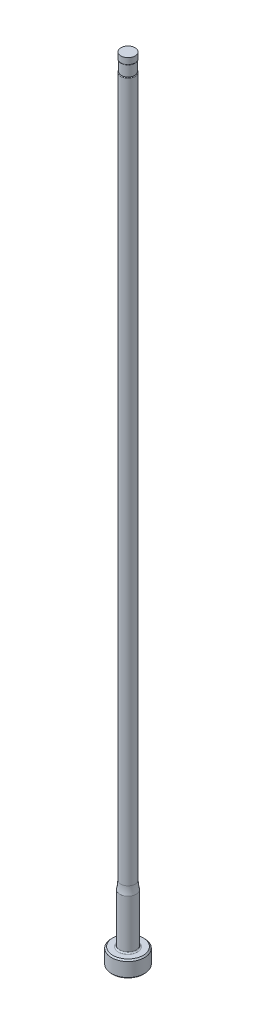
ISO-10303-21;
HEADER;
FILE_DESCRIPTION(('STEP AP214'),'2;1');
FILE_NAME('part.step','',(''),(''),'','','');
FILE_SCHEMA(('AUTOMOTIVE_DESIGN { 1 0 10303 214 1 1 1 1 }'));
ENDSEC;
DATA;
#1=APPLICATION_CONTEXT('core data for automotive mechanical design processes');
#2=APPLICATION_PROTOCOL_DEFINITION('international standard','automotive_design',2000,#1);
#3=PRODUCT_CONTEXT('',#1,'mechanical');
#4=PRODUCT('Part','Part','',(#3));
#5=PRODUCT_RELATED_PRODUCT_CATEGORY('part','',(#4));
#6=PRODUCT_DEFINITION_FORMATION('','',#4);
#7=PRODUCT_DEFINITION_CONTEXT('part definition',#1,'design');
#8=PRODUCT_DEFINITION('design','',#6,#7);
#9=PRODUCT_DEFINITION_SHAPE('','',#8);
#10=(LENGTH_UNIT() NAMED_UNIT(*) SI_UNIT(.MILLI.,.METRE.));
#11=(NAMED_UNIT(*) PLANE_ANGLE_UNIT() SI_UNIT($,.RADIAN.));
#12=(NAMED_UNIT(*) SI_UNIT($,.STERADIAN.) SOLID_ANGLE_UNIT());
#13=UNCERTAINTY_MEASURE_WITH_UNIT(LENGTH_MEASURE(1.E-05),#10,'distance_accuracy_value','');
#14=(GEOMETRIC_REPRESENTATION_CONTEXT(3) GLOBAL_UNCERTAINTY_ASSIGNED_CONTEXT((#13)) GLOBAL_UNIT_ASSIGNED_CONTEXT((#10,
#11,#12)) REPRESENTATION_CONTEXT('',''));
#15=CARTESIAN_POINT('',(0.,0.,0.));
#16=DIRECTION('',(0.,0.,1.));
#17=DIRECTION('',(1.,0.,0.));
#18=AXIS2_PLACEMENT_3D('',#15,#16,#17);
#19=CARTESIAN_POINT('',(0.,259.958771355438,0.));
#20=DIRECTION('',(0.,1.,0.));
#21=DIRECTION('',(0.,0.,1.));
#22=AXIS2_PLACEMENT_3D('',#19,#20,#21);
#23=CYLINDRICAL_SURFACE('',#22,1.38810999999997);
#24=DIRECTION('',(0.,1.,0.));
#25=VECTOR('',#24,1.);
#26=CARTESIAN_POINT('',(-1.28650999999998,259.958771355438,-0.521288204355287));
#27=LINE('',#26,#25);
#28=CARTESIAN_POINT('',(-1.28650999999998,148.973565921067,-0.521288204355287));
#29=VERTEX_POINT('',#28);
#30=CARTESIAN_POINT('',(-1.28650999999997,112.014,-0.521288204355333));
#31=VERTEX_POINT('',#30);
#32=EDGE_CURVE('E66',#29,#31,#27,.F.);
#33=ORIENTED_EDGE('',*,*,#32,.F.);
#34=CARTESIAN_POINT('',(0.,148.973565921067,0.));
#35=DIRECTION('',(0.,1.,0.));
#36=DIRECTION('',(0.,0.,1.));
#37=AXIS2_PLACEMENT_3D('',#34,#35,#36);
#38=CIRCLE('',#37,1.38810999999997);
#39=CARTESIAN_POINT('',(-1.28650999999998,148.973565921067,0.521288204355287));
#40=VERTEX_POINT('',#39);
#41=EDGE_CURVE('E44',#29,#40,#38,.F.);
#42=ORIENTED_EDGE('',*,*,#41,.T.);
#43=DIRECTION('',(0.,1.,0.));
#44=VECTOR('',#43,1.);
#45=CARTESIAN_POINT('',(-1.28650999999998,259.958771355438,0.521288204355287));
#46=LINE('',#45,#44);
#47=CARTESIAN_POINT('',(-1.28650999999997,112.014,0.521288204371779));
#48=VERTEX_POINT('',#47);
#49=EDGE_CURVE('E72',#48,#40,#46,.T.);
#50=ORIENTED_EDGE('',*,*,#49,.F.);
#51=CARTESIAN_POINT('',(-1.28650999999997,112.014,-0.521288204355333));
#52=CARTESIAN_POINT('',(-1.28650942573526,111.988928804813,-0.521284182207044));
#53=CARTESIAN_POINT('',(-1.28680726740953,111.963865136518,-0.520555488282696));
#54=CARTESIAN_POINT('',(-1.28799191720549,111.913826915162,-0.517619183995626));
#55=CARTESIAN_POINT('',(-1.28887900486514,111.888852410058,-0.515410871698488));
#56=CARTESIAN_POINT('',(-1.29243982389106,111.813619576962,-0.506452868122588));
#57=CARTESIAN_POINT('',(-1.29601290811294,111.763650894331,-0.49736839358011));
#58=CARTESIAN_POINT('',(-1.30530992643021,111.665479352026,-0.472434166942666));
#59=CARTESIAN_POINT('',(-1.31103961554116,111.617281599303,-0.456566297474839));
#60=CARTESIAN_POINT('',(-1.32412375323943,111.524513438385,-0.417110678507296));
#61=CARTESIAN_POINT('',(-1.33146964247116,111.479925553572,-0.393563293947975));
#62=CARTESIAN_POINT('',(-1.34350828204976,111.414593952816,-0.349438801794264));
#63=CARTESIAN_POINT('',(-1.34799903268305,111.391780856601,-0.331865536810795));
#64=CARTESIAN_POINT('',(-1.35686421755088,111.34896367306,-0.29352417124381));
#65=CARTESIAN_POINT('',(-1.36123876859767,111.328956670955,-0.272759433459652));
#66=CARTESIAN_POINT('',(-1.36869665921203,111.296112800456,-0.232084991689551));
#67=CARTESIAN_POINT('',(-1.37186978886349,111.282633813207,-0.212714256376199));
#68=CARTESIAN_POINT('',(-1.37757131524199,111.25895318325,-0.171955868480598));
#69=CARTESIAN_POINT('',(-1.38010004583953,111.248749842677,-0.150569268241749));
#70=CARTESIAN_POINT('',(-1.38424028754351,111.232264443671,-0.105984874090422));
#71=CARTESIAN_POINT('',(-1.38584269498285,111.226021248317,-0.0827715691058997));
#72=CARTESIAN_POINT('',(-1.3878558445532,111.218203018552,-0.0355242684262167));
#73=CARTESIAN_POINT('',(-1.38826785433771,111.216623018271,-0.0114911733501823));
#74=CARTESIAN_POINT('',(-1.38787374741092,111.218145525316,0.0326639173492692));
#75=CARTESIAN_POINT('',(-1.38724652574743,111.220560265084,0.0528147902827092));
#76=CARTESIAN_POINT('',(-1.38517272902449,111.228639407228,0.0924056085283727));
#77=CARTESIAN_POINT('',(-1.38372605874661,111.234304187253,0.111845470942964));
#78=CARTESIAN_POINT('',(-1.38015682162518,111.248532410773,0.149590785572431));
#79=CARTESIAN_POINT('',(-1.37803307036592,111.257100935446,0.167894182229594));
#80=CARTESIAN_POINT('',(-1.37329208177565,111.276682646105,0.203060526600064));
#81=CARTESIAN_POINT('',(-1.3706746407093,111.287696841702,0.219922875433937));
#82=CARTESIAN_POINT('',(-1.36363743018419,111.318179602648,0.260714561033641));
#83=CARTESIAN_POINT('',(-1.35900359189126,111.339015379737,0.283587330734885));
#84=CARTESIAN_POINT('',(-1.34954115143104,111.384071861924,0.325660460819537));
#85=CARTESIAN_POINT('',(-1.34471211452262,111.408300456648,0.344852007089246));
#86=CARTESIAN_POINT('',(-1.3331073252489,111.470742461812,0.387781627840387));
#87=CARTESIAN_POINT('',(-1.32644843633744,111.510293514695,0.409600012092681));
#88=CARTESIAN_POINT('',(-1.31433631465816,111.592492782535,0.446935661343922));
#89=CARTESIAN_POINT('',(-1.3088875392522,111.635151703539,0.462429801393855));
#90=CARTESIAN_POINT('',(-1.29848168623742,111.733173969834,0.491004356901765));
#91=CARTESIAN_POINT('',(-1.29398787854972,111.789047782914,0.50251359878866));
#92=CARTESIAN_POINT('',(-1.2895011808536,111.873377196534,0.513856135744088));
#93=CARTESIAN_POINT('',(-1.28838136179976,111.901428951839,0.516650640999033));
#94=CARTESIAN_POINT('',(-1.28688584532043,111.957649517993,0.520362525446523));
#95=CARTESIAN_POINT('',(-1.28650943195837,111.985818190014,0.521281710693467));
#96=CARTESIAN_POINT('',(-1.28650999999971,112.013999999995,0.521288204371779));
#97=B_SPLINE_CURVE_WITH_KNOTS('',3,(#51,#52,#53,#54,#55,#56,#57,#58,#59,#60,#61,#62,#63,#64,#65,
#66,#67,#68,#69,#70,#71,#72,#73,#74,#75,#76,#77,#78,#79,#80,#81,#82,#83,#84,#85,#86,#87,#88,#89,
#90,#91,#92,#93,#94,#95,#96),.UNSPECIFIED.,.F.,.F.,(4,2,2,2,2,2,2,2,2,2,2,2,2,2,2,2,2,2,2,2,2,2,
4),(0.,0.0751855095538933,0.15040671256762,0.30263293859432,0.455268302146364,0.607113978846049,
0.694309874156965,0.781414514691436,0.852578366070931,0.923705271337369,0.99551980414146,
1.06725783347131,1.12787752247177,1.18850425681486,1.2492376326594,1.30999612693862,
1.40332110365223,1.49686681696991,1.63308593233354,1.76979877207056,1.94068119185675,
2.02526314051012,2.10976359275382),.UNSPECIFIED.);
#98=EDGE_CURVE('E74',#31,#48,#97,.T.);
#99=ORIENTED_EDGE('',*,*,#98,.F.);
#100=EDGE_LOOP('',(#33,#42,#50,#99));
#101=FACE_BOUND('',#100,.T.);
#102=CARTESIAN_POINT('',(0.,14.2787642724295,0.));
#103=DIRECTION('',(0.,1.,0.));
#104=DIRECTION('',(0.,0.,1.));
#105=AXIS2_PLACEMENT_3D('',#102,#103,#104);
#106=CIRCLE('',#105,1.38810999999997);
#107=CARTESIAN_POINT('',(0.,14.2787642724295,1.38810999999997));
#108=VERTEX_POINT('',#107);
#109=EDGE_CURVE('E95',#108,#108,#106,.T.);
#110=ORIENTED_EDGE('',*,*,#109,.T.);
#111=EDGE_LOOP('',(#110));
#112=FACE_BOUND('',#111,.T.);
#113=ADVANCED_FACE('F36',(#101,#112),#23,.T.);
#114=CARTESIAN_POINT('',(0.,14.2787642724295,0.));
#115=DIRECTION('',(0.,1.,0.));
#116=DIRECTION('',(0.,0.,1.));
#117=AXIS2_PLACEMENT_3D('',#114,#115,#116);
#118=TOROIDAL_SURFACE('',#117,7.73810999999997,6.35);
#119=CARTESIAN_POINT('',(0.,12.7,0.));
#120=DIRECTION('',(0.,1.,0.));
#121=DIRECTION('',(0.,0.,1.));
#122=AXIS2_PLACEMENT_3D('',#119,#120,#121);
#123=CIRCLE('',#122,1.58749999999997);
#124=CARTESIAN_POINT('',(0.,12.7,1.58749999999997));
#125=VERTEX_POINT('',#124);
#126=EDGE_CURVE('E92',#125,#125,#123,.T.);
#127=ORIENTED_EDGE('',*,*,#126,.T.);
#128=EDGE_LOOP('',(#127));
#129=FACE_BOUND('',#128,.T.);
#130=ORIENTED_EDGE('',*,*,#109,.F.);
#131=EDGE_LOOP('',(#130));
#132=FACE_BOUND('',#131,.T.);
#133=ADVANCED_FACE('F156',(#129,#132),#118,.F.);
#134=CARTESIAN_POINT('',(0.,259.958771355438,0.));
#135=DIRECTION('',(0.,1.,0.));
#136=DIRECTION('',(0.,0.,1.));
#137=AXIS2_PLACEMENT_3D('',#134,#135,#136);
#138=CYLINDRICAL_SURFACE('',#137,1.58749999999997);
#139=CARTESIAN_POINT('',(0.,3.42900000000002,0.));
#140=DIRECTION('',(0.,1.,0.));
#141=DIRECTION('',(0.,0.,1.));
#142=AXIS2_PLACEMENT_3D('',#139,#140,#141);
#143=CIRCLE('',#142,1.58749999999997);
#144=CARTESIAN_POINT('',(0.,3.42900000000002,1.58749999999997));
#145=VERTEX_POINT('',#144);
#146=EDGE_CURVE('E110',#145,#145,#143,.T.);
#147=ORIENTED_EDGE('',*,*,#146,.T.);
#148=EDGE_LOOP('',(#147));
#149=FACE_BOUND('',#148,.T.);
#150=ORIENTED_EDGE('',*,*,#126,.F.);
#151=EDGE_LOOP('',(#150));
#152=FACE_BOUND('',#151,.T.);
#153=ADVANCED_FACE('F153',(#149,#152),#138,.T.);
#154=CARTESIAN_POINT('',(-3.17499999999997,3.175,0.));
#155=DIRECTION('',(0.,1.,0.));
#156=DIRECTION('',(0.,0.,1.));
#157=AXIS2_PLACEMENT_3D('',#154,#155,#156);
#158=PLANE('',#157);
#159=CARTESIAN_POINT('',(0.,3.175,0.));
#160=DIRECTION('',(0.,1.,0.));
#161=DIRECTION('',(0.,0.,1.));
#162=AXIS2_PLACEMENT_3D('',#159,#160,#161);
#163=CIRCLE('',#162,1.84149999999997);
#164=CARTESIAN_POINT('',(0.,3.175,1.84149999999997));
#165=VERTEX_POINT('',#164);
#166=EDGE_CURVE('E78',#165,#165,#163,.F.);
#167=ORIENTED_EDGE('',*,*,#166,.T.);
#168=EDGE_LOOP('',(#167));
#169=FACE_BOUND('',#168,.T.);
#170=CARTESIAN_POINT('',(0.,3.175,0.));
#171=DIRECTION('',(0.,1.,0.));
#172=DIRECTION('',(0.,0.,1.));
#173=AXIS2_PLACEMENT_3D('',#170,#171,#172);
#174=CIRCLE('',#173,2.92099999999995);
#175=CARTESIAN_POINT('',(0.,3.175,2.92099999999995));
#176=VERTEX_POINT('',#175);
#177=EDGE_CURVE('E98',#176,#176,#174,.T.);
#178=ORIENTED_EDGE('',*,*,#177,.T.);
#179=EDGE_LOOP('',(#178));
#180=FACE_BOUND('',#179,.T.);
#181=ADVANCED_FACE('F149',(#169,#180),#158,.T.);
#182=CARTESIAN_POINT('',(0.,259.958771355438,0.));
#183=DIRECTION('',(0.,1.,0.));
#184=DIRECTION('',(0.,0.,1.));
#185=AXIS2_PLACEMENT_3D('',#182,#183,#184);
#186=CYLINDRICAL_SURFACE('',#185,3.17499999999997);
#187=CARTESIAN_POINT('',(0.,2.92100000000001,0.));
#188=DIRECTION('',(0.,1.,0.));
#189=DIRECTION('',(0.,0.,1.));
#190=AXIS2_PLACEMENT_3D('',#187,#188,#189);
#191=CIRCLE('',#190,3.17499999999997);
#192=CARTESIAN_POINT('',(0.,2.92100000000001,3.17499999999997));
#193=VERTEX_POINT('',#192);
#194=EDGE_CURVE('E104',#193,#193,#191,.F.);
#195=ORIENTED_EDGE('',*,*,#194,.T.);
#196=EDGE_LOOP('',(#195));
#197=FACE_BOUND('',#196,.T.);
#198=CARTESIAN_POINT('',(0.,0.254000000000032,0.));
#199=DIRECTION('',(0.,-1.,0.));
#200=DIRECTION('',(0.,0.,-1.));
#201=AXIS2_PLACEMENT_3D('',#198,#199,#200);
#202=CIRCLE('',#201,3.17499999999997);
#203=CARTESIAN_POINT('',(0.,0.254000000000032,-3.17499999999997));
#204=VERTEX_POINT('',#203);
#205=EDGE_CURVE('E101',#204,#204,#202,.F.);
#206=ORIENTED_EDGE('',*,*,#205,.T.);
#207=EDGE_LOOP('',(#206));
#208=FACE_BOUND('',#207,.T.);
#209=ADVANCED_FACE('F145',(#197,#208),#186,.T.);
#210=CARTESIAN_POINT('',(0.,0.,0.));
#211=DIRECTION('',(0.,-1.,0.));
#212=DIRECTION('',(0.,0.,-1.));
#213=AXIS2_PLACEMENT_3D('',#210,#211,#212);
#214=PLANE('',#213);
#215=CARTESIAN_POINT('',(0.,0.,0.));
#216=DIRECTION('',(0.,-1.,0.));
#217=DIRECTION('',(0.,0.,-1.));
#218=AXIS2_PLACEMENT_3D('',#215,#216,#217);
#219=CIRCLE('',#218,2.92099999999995);
#220=CARTESIAN_POINT('',(0.,0.,-2.92099999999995));
#221=VERTEX_POINT('',#220);
#222=EDGE_CURVE('E107',#221,#221,#219,.T.);
#223=ORIENTED_EDGE('',*,*,#222,.T.);
#224=EDGE_LOOP('',(#223));
#225=FACE_BOUND('',#224,.T.);
#226=ADVANCED_FACE('F141',(#225),#214,.T.);
#227=CARTESIAN_POINT('',(0.,3.17499999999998,0.));
#228=DIRECTION('',(0.,-1.,0.));
#229=DIRECTION('',(0.,0.,-1.));
#230=AXIS2_PLACEMENT_3D('',#227,#228,#229);
#231=CONICAL_SURFACE('',#230,2.92099999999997,0.7853981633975);
#232=ORIENTED_EDGE('',*,*,#194,.F.);
#233=EDGE_LOOP('',(#232));
#234=FACE_BOUND('',#233,.T.);
#235=ORIENTED_EDGE('',*,*,#177,.F.);
#236=EDGE_LOOP('',(#235));
#237=FACE_BOUND('',#236,.T.);
#238=ADVANCED_FACE('F144',(#234,#237),#231,.T.);
#239=CARTESIAN_POINT('',(0.,0.254000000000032,0.));
#240=DIRECTION('',(0.,1.,0.));
#241=DIRECTION('',(0.,0.,1.));
#242=AXIS2_PLACEMENT_3D('',#239,#240,#241);
#243=CONICAL_SURFACE('',#242,3.17499999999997,0.785398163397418);
#244=ORIENTED_EDGE('',*,*,#222,.F.);
#245=EDGE_LOOP('',(#244));
#246=FACE_BOUND('',#245,.T.);
#247=ORIENTED_EDGE('',*,*,#205,.F.);
#248=EDGE_LOOP('',(#247));
#249=FACE_BOUND('',#248,.T.);
#250=ADVANCED_FACE('F245',(#246,#249),#243,.T.);
#251=CARTESIAN_POINT('',(0.,3.42900000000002,0.));
#252=DIRECTION('',(0.,1.,0.));
#253=DIRECTION('',(0.,0.,1.));
#254=AXIS2_PLACEMENT_3D('',#251,#252,#253);
#255=TOROIDAL_SURFACE('',#254,1.84149999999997,0.254);
#256=ORIENTED_EDGE('',*,*,#166,.F.);
#257=EDGE_LOOP('',(#256));
#258=FACE_BOUND('',#257,.T.);
#259=ORIENTED_EDGE('',*,*,#146,.F.);
#260=EDGE_LOOP('',(#259));
#261=FACE_BOUND('',#260,.T.);
#262=ADVANCED_FACE('F139',(#258,#261),#255,.F.);
#263=CARTESIAN_POINT('',(0.,153.448281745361,0.));
#264=DIRECTION('',(0.,1.,0.));
#265=DIRECTION('',(0.,0.,1.));
#266=AXIS2_PLACEMENT_3D('',#263,#264,#265);
#267=CYLINDRICAL_SURFACE('',#266,1.28650999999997);
#268=CARTESIAN_POINT('',(0.,151.13,0.));
#269=DIRECTION('',(0.,1.,0.));
#270=DIRECTION('',(0.,0.,1.));
#271=AXIS2_PLACEMENT_3D('',#268,#269,#270);
#272=CIRCLE('',#271,1.28650999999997);
#273=CARTESIAN_POINT('',(0.,151.13,1.28650999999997));
#274=VERTEX_POINT('',#273);
#275=EDGE_CURVE('E71',#274,#274,#272,.T.);
#276=ORIENTED_EDGE('',*,*,#275,.F.);
#277=EDGE_LOOP('',(#276));
#278=FACE_BOUND('',#277,.T.);
#279=CARTESIAN_POINT('',(0.,149.098,0.));
#280=DIRECTION('',(0.,1.,0.));
#281=DIRECTION('',(0.,0.,1.));
#282=AXIS2_PLACEMENT_3D('',#279,#280,#281);
#283=CIRCLE('',#282,1.28650999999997);
#284=CARTESIAN_POINT('',(-1.28650999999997,149.098,0.));
#285=VERTEX_POINT('',#284);
#286=EDGE_CURVE('E89',#285,#285,#283,.T.);
#287=ORIENTED_EDGE('',*,*,#286,.T.);
#288=EDGE_LOOP('',(#287));
#289=FACE_BOUND('',#288,.T.);
#290=ADVANCED_FACE('F136',(#278,#289),#267,.T.);
#291=CARTESIAN_POINT('',(-1.28650999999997,150.114,-3.17499999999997));
#292=DIRECTION('',(1.,0.,0.));
#293=DIRECTION('',(0.,1.,0.));
#294=AXIS2_PLACEMENT_3D('',#291,#292,#293);
#295=PLANE('',#294);
#296=CARTESIAN_POINT('',(-1.28650999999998,148.973565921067,0.521288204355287));
#297=CARTESIAN_POINT('',(-1.28650999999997,148.976543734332,0.521296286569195));
#298=CARTESIAN_POINT('',(-1.28650999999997,148.97951092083,0.521009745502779));
#299=CARTESIAN_POINT('',(-1.28650999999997,148.985314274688,0.519922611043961));
#300=CARTESIAN_POINT('',(-1.28650999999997,148.988151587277,0.519128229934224));
#301=CARTESIAN_POINT('',(-1.28650999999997,148.99428840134,0.516865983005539));
#302=CARTESIAN_POINT('',(-1.28650999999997,148.997545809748,0.515285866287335));
#303=CARTESIAN_POINT('',(-1.28650999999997,149.003773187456,0.511618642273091));
#304=CARTESIAN_POINT('',(-1.28650999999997,149.00674164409,0.509529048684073));
#305=CARTESIAN_POINT('',(-1.28650999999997,149.014061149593,0.50363303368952));
#306=CARTESIAN_POINT('',(-1.28650999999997,149.018183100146,0.49954516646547));
#307=CARTESIAN_POINT('',(-1.28650999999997,149.025782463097,0.490820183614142));
#308=CARTESIAN_POINT('',(-1.28650999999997,149.029258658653,0.486182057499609));
#309=CARTESIAN_POINT('',(-1.28650999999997,149.039007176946,0.471627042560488));
#310=CARTESIAN_POINT('',(-1.28650999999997,149.044482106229,0.461183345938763));
#311=CARTESIAN_POINT('',(-1.28650999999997,149.054043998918,0.439690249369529));
#312=CARTESIAN_POINT('',(-1.28650999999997,149.058126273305,0.42863894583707));
#313=CARTESIAN_POINT('',(-1.28650999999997,149.06562285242,0.405219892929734));
#314=CARTESIAN_POINT('',(-1.28650999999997,149.068944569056,0.392822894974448));
#315=CARTESIAN_POINT('',(-1.28650999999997,149.074742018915,0.367829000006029));
#316=CARTESIAN_POINT('',(-1.28650999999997,149.077216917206,0.355231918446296));
#317=CARTESIAN_POINT('',(-1.28650999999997,149.083717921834,0.317205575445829));
#318=CARTESIAN_POINT('',(-1.28650999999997,149.086799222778,0.291618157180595));
#319=CARTESIAN_POINT('',(-1.28650999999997,149.09153097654,0.24018142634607));
#320=CARTESIAN_POINT('',(-1.28650999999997,149.093172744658,0.214331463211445));
#321=CARTESIAN_POINT('',(-1.28650999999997,149.095602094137,0.162584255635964));
#322=CARTESIAN_POINT('',(-1.28650999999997,149.096389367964,0.13668699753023));
#323=CARTESIAN_POINT('',(-1.28650999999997,149.097321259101,0.0922416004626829));
#324=CARTESIAN_POINT('',(-1.28650999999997,149.097584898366,0.0736953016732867));
#325=CARTESIAN_POINT('',(-1.28650999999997,149.097919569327,0.0367659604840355));
#326=CARTESIAN_POINT('',(-1.28650999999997,149.097992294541,0.0183829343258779));
#327=CARTESIAN_POINT('',(-1.28650999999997,149.098,0.));
#328=B_SPLINE_CURVE_WITH_KNOTS('',3,(#296,#297,#298,#299,#300,#301,#302,#303,#304,#305,#306,
#307,#308,#309,#310,#311,#312,#313,#314,#315,#316,#317,#318,#319,#320,#321,#322,#323,#324,#325,
#326,#327),.UNSPECIFIED.,.F.,.F.,(4,2,2,2,2,2,2,2,2,2,2,2,2,2,2,4),(0.,0.00890253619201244,
0.0176982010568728,0.0284990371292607,0.0393536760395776,0.056671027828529,0.0740206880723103,
0.109198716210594,0.144494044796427,0.182950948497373,0.221445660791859,0.298673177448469,
0.376363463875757,0.454081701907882,0.509725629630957,0.564874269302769),.UNSPECIFIED.);
#329=EDGE_CURVE('E77',#40,#285,#328,.T.);
#330=ORIENTED_EDGE('',*,*,#329,.T.);
#331=CARTESIAN_POINT('',(-1.28650999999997,149.098,0.));
#332=CARTESIAN_POINT('',(-1.28650999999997,149.097985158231,-0.0211574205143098));
#333=CARTESIAN_POINT('',(-1.28650999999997,149.097892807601,-0.0423161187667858));
#334=CARTESIAN_POINT('',(-1.28650999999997,149.097447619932,-0.0846465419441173));
#335=CARTESIAN_POINT('',(-1.28650999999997,149.097094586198,-0.105818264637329));
#336=CARTESIAN_POINT('',(-1.28650999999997,149.096021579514,-0.148180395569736));
#337=CARTESIAN_POINT('',(-1.28650999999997,149.095301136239,-0.169370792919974));
#338=CARTESIAN_POINT('',(-1.28650999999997,149.093275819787,-0.211719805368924));
#339=CARTESIAN_POINT('',(-1.28650999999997,149.091971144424,-0.232878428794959));
#340=CARTESIAN_POINT('',(-1.28650999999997,149.088936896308,-0.269239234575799));
#341=CARTESIAN_POINT('',(-1.28650999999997,149.087426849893,-0.284459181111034));
#342=CARTESIAN_POINT('',(-1.28650999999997,149.083747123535,-0.314836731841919));
#343=CARTESIAN_POINT('',(-1.28650999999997,149.081576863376,-0.329994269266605));
#344=CARTESIAN_POINT('',(-1.28650999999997,149.076226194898,-0.36070634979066));
#345=CARTESIAN_POINT('',(-1.28650999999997,149.073011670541,-0.376255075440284));
#346=CARTESIAN_POINT('',(-1.28650999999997,149.065175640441,-0.406994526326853));
#347=CARTESIAN_POINT('',(-1.28650999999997,149.060556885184,-0.422185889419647));
#348=CARTESIAN_POINT('',(-1.28650999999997,149.052067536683,-0.444158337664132));
#349=CARTESIAN_POINT('',(-1.28650999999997,149.049027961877,-0.451257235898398));
#350=CARTESIAN_POINT('',(-1.28650999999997,149.042272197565,-0.465143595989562));
#351=CARTESIAN_POINT('',(-1.28650999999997,149.038555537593,-0.47193083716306));
#352=CARTESIAN_POINT('',(-1.28650999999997,149.031166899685,-0.483496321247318));
#353=CARTESIAN_POINT('',(-1.28650999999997,149.027669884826,-0.48838498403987));
#354=CARTESIAN_POINT('',(-1.28650999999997,149.020009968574,-0.497611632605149));
#355=CARTESIAN_POINT('',(-1.28650999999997,149.01584924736,-0.501951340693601));
#356=CARTESIAN_POINT('',(-1.28650999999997,149.008744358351,-0.507990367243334));
#357=CARTESIAN_POINT('',(-1.28650999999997,149.006073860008,-0.510009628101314));
#358=CARTESIAN_POINT('',(-1.28650999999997,149.000472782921,-0.513654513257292));
#359=CARTESIAN_POINT('',(-1.28650999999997,148.997542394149,-0.515280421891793));
#360=CARTESIAN_POINT('',(-1.28650999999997,148.991862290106,-0.517827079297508));
#361=CARTESIAN_POINT('',(-1.28650999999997,148.989142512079,-0.518813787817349));
#362=CARTESIAN_POINT('',(-1.28650999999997,148.983578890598,-0.520316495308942));
#363=CARTESIAN_POINT('',(-1.28650999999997,148.980735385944,-0.520833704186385));
#364=CARTESIAN_POINT('',(-1.28650999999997,148.976439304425,-0.521223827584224));
#365=CARTESIAN_POINT('',(-1.28650999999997,148.975002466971,-0.52128961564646));
#366=CARTESIAN_POINT('',(-1.28650999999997,148.973565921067,-0.521288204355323));
#367=B_SPLINE_CURVE_WITH_KNOTS('',3,(#331,#332,#333,#334,#335,#336,#337,#338,#339,#340,#341,
#342,#343,#344,#345,#346,#347,#348,#349,#350,#351,#352,#353,#354,#355,#356,#357,#358,#359,#360,
#361,#362,#363,#364,#365,#366),.UNSPECIFIED.,.F.,.F.,(4,2,2,2,2,2,2,2,2,2,2,2,2,2,2,2,2,4),(0.,
0.0634741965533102,0.126996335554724,0.190599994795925,0.254182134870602,0.300056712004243,
0.345971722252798,0.393570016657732,0.441075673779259,0.464219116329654,0.48737870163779,
0.505372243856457,0.523307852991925,0.533326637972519,0.543338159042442,0.551983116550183,
0.560605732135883,0.564915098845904),.UNSPECIFIED.);
#368=EDGE_CURVE('E58',#285,#29,#367,.T.);
#369=ORIENTED_EDGE('',*,*,#368,.T.);
#370=ORIENTED_EDGE('',*,*,#32,.T.);
#371=DIRECTION('',(0.,0.,1.));
#372=VECTOR('',#371,1.);
#373=CARTESIAN_POINT('',(-1.28650999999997,112.014,-3.17499999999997));
#374=LINE('',#373,#372);
#375=EDGE_CURVE('E70',#31,#48,#374,.T.);
#376=ORIENTED_EDGE('',*,*,#375,.T.);
#377=ORIENTED_EDGE('',*,*,#49,.T.);
#378=EDGE_LOOP('',(#330,#369,#370,#376,#377));
#379=FACE_BOUND('',#378,.T.);
#380=ADVANCED_FACE('F68',(#379),#295,.F.);
#381=CARTESIAN_POINT('',(-4.46150999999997,112.014,-3.17499999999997));
#382=DIRECTION('',(0.,0.,1.));
#383=DIRECTION('',(1.,0.,0.));
#384=AXIS2_PLACEMENT_3D('',#381,#382,#383);
#385=CYLINDRICAL_SURFACE('',#384,3.175);
#386=ORIENTED_EDGE('',*,*,#375,.F.);
#387=ORIENTED_EDGE('',*,*,#98,.T.);
#388=EDGE_LOOP('',(#386,#387));
#389=FACE_BOUND('',#388,.T.);
#390=ADVANCED_FACE('F80',(#389),#385,.F.);
#391=CARTESIAN_POINT('',(0.,152.687735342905,0.));
#392=DIRECTION('',(0.,1.,0.));
#393=DIRECTION('',(0.,0.,1.));
#394=AXIS2_PLACEMENT_3D('',#391,#392,#393);
#395=CYLINDRICAL_SURFACE('',#394,1.37540999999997);
#396=CARTESIAN_POINT('',(0.,151.25115027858,0.));
#397=DIRECTION('',(0.,-1.,0.));
#398=DIRECTION('',(0.,0.,-1.));
#399=AXIS2_PLACEMENT_3D('',#396,#397,#398);
#400=CIRCLE('',#399,1.37540999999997);
#401=CARTESIAN_POINT('',(0.,151.25115027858,-1.37540999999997));
#402=VERTEX_POINT('',#401);
#403=EDGE_CURVE('E11',#402,#402,#400,.F.);
#404=ORIENTED_EDGE('',*,*,#403,.T.);
#405=EDGE_LOOP('',(#404));
#406=FACE_BOUND('',#405,.T.);
#407=CARTESIAN_POINT('',(0.,152.4,0.));
#408=DIRECTION('',(0.,1.,0.));
#409=DIRECTION('',(0.,0.,1.));
#410=AXIS2_PLACEMENT_3D('',#407,#408,#409);
#411=CIRCLE('',#410,1.37540999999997);
#412=CARTESIAN_POINT('',(0.,152.4,1.37540999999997));
#413=VERTEX_POINT('',#412);
#414=EDGE_CURVE('E81',#413,#413,#411,.T.);
#415=ORIENTED_EDGE('',*,*,#414,.F.);
#416=EDGE_LOOP('',(#415));
#417=FACE_BOUND('',#416,.T.);
#418=ADVANCED_FACE('F133',(#406,#417),#395,.T.);
#419=CARTESIAN_POINT('',(-1.38810999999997,152.4,0.));
#420=DIRECTION('',(0.,1.,0.));
#421=DIRECTION('',(0.,0.,1.));
#422=AXIS2_PLACEMENT_3D('',#419,#420,#421);
#423=PLANE('',#422);
#424=ORIENTED_EDGE('',*,*,#414,.T.);
#425=EDGE_LOOP('',(#424));
#426=FACE_BOUND('',#425,.T.);
#427=ADVANCED_FACE('F177',(#426),#423,.T.);
#428=CARTESIAN_POINT('',(0.,148.973565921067,0.));
#429=DIRECTION('',(0.,1.,0.));
#430=DIRECTION('',(0.,0.,1.));
#431=AXIS2_PLACEMENT_3D('',#428,#429,#430);
#432=TOROIDAL_SURFACE('',#431,1.26110999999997,0.127);
#433=ORIENTED_EDGE('',*,*,#329,.F.);
#434=ORIENTED_EDGE('',*,*,#41,.F.);
#435=ORIENTED_EDGE('',*,*,#368,.F.);
#436=ORIENTED_EDGE('',*,*,#286,.F.);
#437=EDGE_LOOP('',(#433,#434,#435,#436));
#438=FACE_BOUND('',#437,.T.);
#439=ADVANCED_FACE('F209',(#438),#432,.T.);
#440=CARTESIAN_POINT('',(0.,151.25115027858,0.));
#441=DIRECTION('',(0.,-1.,0.));
#442=DIRECTION('',(0.,0.,-1.));
#443=AXIS2_PLACEMENT_3D('',#440,#441,#442);
#444=TOROIDAL_SURFACE('',#443,1.24840999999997,0.127);
#445=ORIENTED_EDGE('',*,*,#275,.T.);
#446=EDGE_LOOP('',(#445));
#447=FACE_BOUND('',#446,.T.);
#448=ORIENTED_EDGE('',*,*,#403,.F.);
#449=EDGE_LOOP('',(#448));
#450=FACE_BOUND('',#449,.T.);
#451=ADVANCED_FACE('F38',(#447,#450),#444,.T.);
#452=CLOSED_SHELL('',(#113,#133,#153,#181,#209,#226,#238,#250,#262,#290,#380,#390,#418,#427,
#439,#451));
#453=MANIFOLD_SOLID_BREP('B2',#452);
#454=ADVANCED_BREP_SHAPE_REPRESENTATION('',(#18,#453),#14);
#455=SHAPE_DEFINITION_REPRESENTATION(#9,#454);
ENDSEC;
END-ISO-10303-21;
